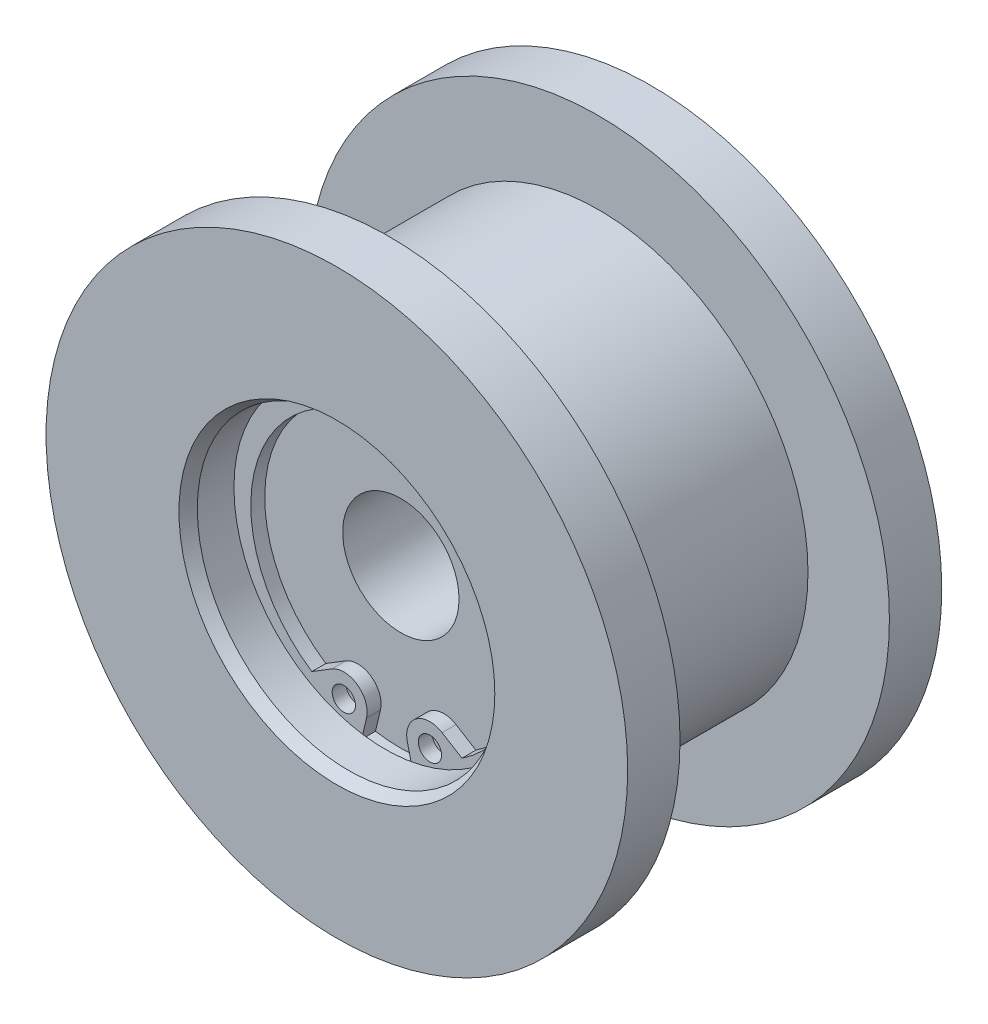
ISO-10303-21;
HEADER;
FILE_DESCRIPTION(('STEP AP214'),'2;1');
FILE_NAME('part.step','',(''),(''),'','','');
FILE_SCHEMA(('AUTOMOTIVE_DESIGN { 1 0 10303 214 1 1 1 1 }'));
ENDSEC;
DATA;
#1=APPLICATION_CONTEXT('core data for automotive mechanical design processes');
#2=APPLICATION_PROTOCOL_DEFINITION('international standard','automotive_design',2000,#1);
#3=PRODUCT_CONTEXT('',#1,'mechanical');
#4=PRODUCT('Part','Part','',(#3));
#5=PRODUCT_RELATED_PRODUCT_CATEGORY('part','',(#4));
#6=PRODUCT_DEFINITION_FORMATION('','',#4);
#7=PRODUCT_DEFINITION_CONTEXT('part definition',#1,'design');
#8=PRODUCT_DEFINITION('design','',#6,#7);
#9=PRODUCT_DEFINITION_SHAPE('','',#8);
#10=(LENGTH_UNIT() NAMED_UNIT(*) SI_UNIT(.MILLI.,.METRE.));
#11=(NAMED_UNIT(*) PLANE_ANGLE_UNIT() SI_UNIT($,.RADIAN.));
#12=(NAMED_UNIT(*) SI_UNIT($,.STERADIAN.) SOLID_ANGLE_UNIT());
#13=UNCERTAINTY_MEASURE_WITH_UNIT(LENGTH_MEASURE(1.E-05),#10,'distance_accuracy_value','');
#14=(GEOMETRIC_REPRESENTATION_CONTEXT(3) GLOBAL_UNCERTAINTY_ASSIGNED_CONTEXT((#13)) GLOBAL_UNIT_ASSIGNED_CONTEXT((#10,
#11,#12)) REPRESENTATION_CONTEXT('',''));
#15=CARTESIAN_POINT('',(0.,0.,0.));
#16=DIRECTION('',(0.,0.,1.));
#17=DIRECTION('',(1.,0.,0.));
#18=AXIS2_PLACEMENT_3D('',#15,#16,#17);
#19=CARTESIAN_POINT('',(0.,-0.75,9.2));
#20=DIRECTION('',(0.,0.,1.));
#21=DIRECTION('',(-1.,0.,0.));
#22=AXIS2_PLACEMENT_3D('',#19,#20,#21);
#23=CYLINDRICAL_SURFACE('',#22,11.7);
#24=CARTESIAN_POINT('',(0.,-0.75,8.));
#25=DIRECTION('',(0.,0.,-1.));
#26=DIRECTION('',(0.,-1.,0.));
#27=AXIS2_PLACEMENT_3D('',#24,#25,#26);
#28=CIRCLE('',#27,11.7);
#29=CARTESIAN_POINT('',(-6.45127454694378,-10.5106893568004,8.));
#30=VERTEX_POINT('',#29);
#31=CARTESIAN_POINT('',(6.45127454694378,-10.5106893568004,8.));
#32=VERTEX_POINT('',#31);
#33=EDGE_CURVE('E105',#30,#32,#28,.T.);
#34=ORIENTED_EDGE('',*,*,#33,.T.);
#35=DIRECTION('',(0.,0.,-1.));
#36=VECTOR('',#35,1.);
#37=CARTESIAN_POINT('',(6.45127454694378,-10.5106893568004,9.2));
#38=LINE('',#37,#36);
#39=CARTESIAN_POINT('',(6.45127454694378,-10.5106893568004,9.2));
#40=VERTEX_POINT('',#39);
#41=EDGE_CURVE('E123',#40,#32,#38,.T.);
#42=ORIENTED_EDGE('',*,*,#41,.F.);
#43=CARTESIAN_POINT('',(0.,-0.75,9.2));
#44=DIRECTION('',(0.,0.,-1.));
#45=DIRECTION('',(0.,-1.,0.));
#46=AXIS2_PLACEMENT_3D('',#43,#44,#45);
#47=CIRCLE('',#46,11.7);
#48=CARTESIAN_POINT('',(-6.45127454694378,-10.5106893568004,9.2));
#49=VERTEX_POINT('',#48);
#50=EDGE_CURVE('E116',#49,#40,#47,.T.);
#51=ORIENTED_EDGE('',*,*,#50,.F.);
#52=DIRECTION('',(0.,0.,-1.));
#53=VECTOR('',#52,1.);
#54=CARTESIAN_POINT('',(-6.45127454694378,-10.5106893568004,9.2));
#55=LINE('',#54,#53);
#56=EDGE_CURVE('E96',#49,#30,#55,.T.);
#57=ORIENTED_EDGE('',*,*,#56,.T.);
#58=EDGE_LOOP('',(#34,#42,#51,#57));
#59=FACE_BOUND('',#58,.T.);
#60=ADVANCED_FACE('F14',(#59),#23,.F.);
#61=CARTESIAN_POINT('',(4.74866968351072,-9.46227797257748,9.2));
#62=DIRECTION('',(-0.524334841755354,-0.851512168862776,0.));
#63=DIRECTION('',(-0.851512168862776,0.524334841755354,0.));
#64=AXIS2_PLACEMENT_3D('',#61,#62,#63);
#65=PLANE('',#64);
#66=DIRECTION('',(-0.851512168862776,0.524334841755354,0.));
#67=VECTOR('',#66,1.);
#68=CARTESIAN_POINT('',(4.74866968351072,-9.46227797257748,8.));
#69=LINE('',#68,#67);
#70=CARTESIAN_POINT('',(4.74866968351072,-9.46227797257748,8.));
#71=VERTEX_POINT('',#70);
#72=EDGE_CURVE('E109',#32,#71,#69,.T.);
#73=ORIENTED_EDGE('',*,*,#72,.T.);
#74=DIRECTION('',(0.,0.,-1.));
#75=VECTOR('',#74,1.);
#76=CARTESIAN_POINT('',(4.74866968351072,-9.46227797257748,9.2));
#77=LINE('',#76,#75);
#78=CARTESIAN_POINT('',(4.74866968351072,-9.46227797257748,9.2));
#79=VERTEX_POINT('',#78);
#80=EDGE_CURVE('E152',#79,#71,#77,.T.);
#81=ORIENTED_EDGE('',*,*,#80,.F.);
#82=DIRECTION('',(-0.851512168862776,0.524334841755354,0.));
#83=VECTOR('',#82,1.);
#84=CARTESIAN_POINT('',(4.74866968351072,-9.46227797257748,9.2));
#85=LINE('',#84,#83);
#86=EDGE_CURVE('E127',#40,#79,#85,.T.);
#87=ORIENTED_EDGE('',*,*,#86,.F.);
#88=ORIENTED_EDGE('',*,*,#41,.T.);
#89=EDGE_LOOP('',(#73,#81,#87,#88));
#90=FACE_BOUND('',#89,.T.);
#91=ADVANCED_FACE('F264',(#90),#65,.F.);
#92=CARTESIAN_POINT('',(3.7,-11.165302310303,9.2));
#93=DIRECTION('',(0.,0.,1.));
#94=DIRECTION('',(-1.,0.,0.));
#95=AXIS2_PLACEMENT_3D('',#92,#93,#94);
#96=CYLINDRICAL_SURFACE('',#95,2.);
#97=CARTESIAN_POINT('',(3.7,-11.165302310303,8.));
#98=DIRECTION('',(0.,0.,1.));
#99=DIRECTION('',(1.,0.,0.));
#100=AXIS2_PLACEMENT_3D('',#97,#98,#99);
#101=CIRCLE('',#100,2.);
#102=CARTESIAN_POINT('',(1.75425849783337,-11.6280009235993,8.));
#103=VERTEX_POINT('',#102);
#104=EDGE_CURVE('E133',#71,#103,#101,.T.);
#105=ORIENTED_EDGE('',*,*,#104,.T.);
#106=DIRECTION('',(0.,0.,-1.));
#107=VECTOR('',#106,1.);
#108=CARTESIAN_POINT('',(1.75425849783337,-11.6280009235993,9.2));
#109=LINE('',#108,#107);
#110=CARTESIAN_POINT('',(1.75425849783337,-11.6280009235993,9.2));
#111=VERTEX_POINT('',#110);
#112=EDGE_CURVE('E144',#111,#103,#109,.T.);
#113=ORIENTED_EDGE('',*,*,#112,.F.);
#114=CARTESIAN_POINT('',(3.7,-11.165302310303,9.2));
#115=DIRECTION('',(0.,0.,1.));
#116=DIRECTION('',(1.,0.,0.));
#117=AXIS2_PLACEMENT_3D('',#114,#115,#116);
#118=CIRCLE('',#117,2.);
#119=EDGE_CURVE('E162',#79,#111,#118,.T.);
#120=ORIENTED_EDGE('',*,*,#119,.F.);
#121=ORIENTED_EDGE('',*,*,#80,.T.);
#122=EDGE_LOOP('',(#105,#113,#120,#121));
#123=FACE_BOUND('',#122,.T.);
#124=ADVANCED_FACE('F269',(#123),#96,.T.);
#125=CARTESIAN_POINT('',(-1.75425849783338,-11.6280009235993,9.2));
#126=DIRECTION('',(-0.97287075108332,0.231349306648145,0.));
#127=DIRECTION('',(0.,0.,1.));
#128=AXIS2_PLACEMENT_3D('',#125,#126,#127);
#129=PLANE('',#128);
#130=DIRECTION('',(0.,0.,1.));
#131=VECTOR('',#130,1.);
#132=CARTESIAN_POINT('',(-2.18133072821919,-13.4239262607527,18.1183293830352));
#133=LINE('',#132,#131);
#134=CARTESIAN_POINT('',(-2.18133072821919,-13.4239262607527,8.));
#135=VERTEX_POINT('',#134);
#136=CARTESIAN_POINT('',(-2.18133072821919,-13.4239262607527,9.2));
#137=VERTEX_POINT('',#136);
#138=EDGE_CURVE('E102',#135,#137,#133,.T.);
#139=ORIENTED_EDGE('',*,*,#138,.F.);
#140=DIRECTION('',(0.231349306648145,0.97287075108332,0.));
#141=VECTOR('',#140,1.);
#142=CARTESIAN_POINT('',(-1.75425849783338,-11.6280009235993,8.));
#143=LINE('',#142,#141);
#144=CARTESIAN_POINT('',(-1.75425849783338,-11.6280009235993,8.));
#145=VERTEX_POINT('',#144);
#146=EDGE_CURVE('E140',#135,#145,#143,.T.);
#147=ORIENTED_EDGE('',*,*,#146,.T.);
#148=DIRECTION('',(0.,0.,-1.));
#149=VECTOR('',#148,1.);
#150=CARTESIAN_POINT('',(-1.75425849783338,-11.6280009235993,9.2));
#151=LINE('',#150,#149);
#152=CARTESIAN_POINT('',(-1.75425849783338,-11.6280009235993,9.2));
#153=VERTEX_POINT('',#152);
#154=EDGE_CURVE('E155',#153,#145,#151,.T.);
#155=ORIENTED_EDGE('',*,*,#154,.F.);
#156=DIRECTION('',(0.231349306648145,0.97287075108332,0.));
#157=VECTOR('',#156,1.);
#158=CARTESIAN_POINT('',(-1.75425849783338,-11.6280009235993,9.2));
#159=LINE('',#158,#157);
#160=EDGE_CURVE('E146',#137,#153,#159,.T.);
#161=ORIENTED_EDGE('',*,*,#160,.F.);
#162=EDGE_LOOP('',(#139,#147,#155,#161));
#163=FACE_BOUND('',#162,.T.);
#164=ADVANCED_FACE('F322',(#163),#129,.F.);
#165=CARTESIAN_POINT('',(0.,-0.75,9.2));
#166=DIRECTION('',(0.,0.,-1.));
#167=DIRECTION('',(0.,-1.,0.));
#168=AXIS2_PLACEMENT_3D('',#165,#166,#167);
#169=PLANE('',#168);
#170=CARTESIAN_POINT('',(3.7,-11.165302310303,9.2));
#171=DIRECTION('',(0.,0.,1.));
#172=DIRECTION('',(1.,0.,0.));
#173=AXIS2_PLACEMENT_3D('',#170,#171,#172);
#174=CIRCLE('',#173,1.);
#175=CARTESIAN_POINT('',(4.7,-11.165302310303,9.2));
#176=VERTEX_POINT('',#175);
#177=EDGE_CURVE('E134',#176,#176,#174,.T.);
#178=ORIENTED_EDGE('',*,*,#177,.F.);
#179=EDGE_LOOP('',(#178));
#180=FACE_BOUND('',#179,.T.);
#181=CARTESIAN_POINT('',(-3.7,-11.165302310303,9.2));
#182=DIRECTION('',(0.,0.,-1.));
#183=DIRECTION('',(1.,0.,0.));
#184=AXIS2_PLACEMENT_3D('',#181,#182,#183);
#185=CIRCLE('',#184,1.);
#186=CARTESIAN_POINT('',(-2.7,-11.165302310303,9.2));
#187=VERTEX_POINT('',#186);
#188=EDGE_CURVE('E129',#187,#187,#185,.T.);
#189=ORIENTED_EDGE('',*,*,#188,.T.);
#190=EDGE_LOOP('',(#189));
#191=FACE_BOUND('',#190,.T.);
#192=CARTESIAN_POINT('',(0.,0.,9.2));
#193=DIRECTION('',(0.,0.,-1.));
#194=DIRECTION('',(-1.,0.,0.));
#195=AXIS2_PLACEMENT_3D('',#192,#193,#194);
#196=CIRCLE('',#195,13.6);
#197=CARTESIAN_POINT('',(2.18133072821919,-13.4239262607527,9.2));
#198=VERTEX_POINT('',#197);
#199=EDGE_CURVE('E9',#137,#198,#196,.T.);
#200=ORIENTED_EDGE('',*,*,#199,.F.);
#201=ORIENTED_EDGE('',*,*,#160,.T.);
#202=CARTESIAN_POINT('',(-3.7,-11.165302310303,9.2));
#203=DIRECTION('',(0.,0.,1.));
#204=DIRECTION('',(-1.,0.,0.));
#205=AXIS2_PLACEMENT_3D('',#202,#203,#204);
#206=CIRCLE('',#205,2.);
#207=CARTESIAN_POINT('',(-4.74866968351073,-9.46227797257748,9.2));
#208=VERTEX_POINT('',#207);
#209=EDGE_CURVE('E132',#153,#208,#206,.T.);
#210=ORIENTED_EDGE('',*,*,#209,.T.);
#211=DIRECTION('',(-0.851512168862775,-0.524334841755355,0.));
#212=VECTOR('',#211,1.);
#213=CARTESIAN_POINT('',(-4.74866968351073,-9.46227797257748,9.2));
#214=LINE('',#213,#212);
#215=EDGE_CURVE('E334',#208,#49,#214,.T.);
#216=ORIENTED_EDGE('',*,*,#215,.T.);
#217=ORIENTED_EDGE('',*,*,#50,.T.);
#218=ORIENTED_EDGE('',*,*,#86,.T.);
#219=ORIENTED_EDGE('',*,*,#119,.T.);
#220=DIRECTION('',(0.231349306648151,-0.972870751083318,0.));
#221=VECTOR('',#220,1.);
#222=CARTESIAN_POINT('',(1.75425849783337,-11.6280009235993,9.2));
#223=LINE('',#222,#221);
#224=EDGE_CURVE('E149',#111,#198,#223,.T.);
#225=ORIENTED_EDGE('',*,*,#224,.T.);
#226=EDGE_LOOP('',(#200,#201,#210,#216,#217,#218,#219,#225));
#227=FACE_BOUND('',#226,.T.);
#228=ADVANCED_FACE('F274',(#180,#191,#227),#169,.F.);
#229=CARTESIAN_POINT('',(3.7,-11.165302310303,9.2));
#230=DIRECTION('',(0.,0.,1.));
#231=DIRECTION('',(-1.,0.,0.));
#232=AXIS2_PLACEMENT_3D('',#229,#230,#231);
#233=CYLINDRICAL_SURFACE('',#232,1.);
#234=CARTESIAN_POINT('',(3.7,-11.165302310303,8.));
#235=DIRECTION('',(0.,0.,1.));
#236=DIRECTION('',(1.,0.,0.));
#237=AXIS2_PLACEMENT_3D('',#234,#235,#236);
#238=CIRCLE('',#237,1.);
#239=CARTESIAN_POINT('',(4.7,-11.165302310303,8.));
#240=VERTEX_POINT('',#239);
#241=EDGE_CURVE('E114',#240,#240,#238,.T.);
#242=ORIENTED_EDGE('',*,*,#241,.F.);
#243=EDGE_LOOP('',(#242));
#244=FACE_BOUND('',#243,.T.);
#245=ORIENTED_EDGE('',*,*,#177,.T.);
#246=EDGE_LOOP('',(#245));
#247=FACE_BOUND('',#246,.T.);
#248=ADVANCED_FACE('F363',(#244,#247),#233,.F.);
#249=CARTESIAN_POINT('',(-3.7,-11.165302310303,9.2));
#250=DIRECTION('',(0.,0.,1.));
#251=DIRECTION('',(-1.,0.,0.));
#252=AXIS2_PLACEMENT_3D('',#249,#250,#251);
#253=CYLINDRICAL_SURFACE('',#252,1.);
#254=CARTESIAN_POINT('',(-3.7,-11.165302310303,8.));
#255=DIRECTION('',(0.,0.,-1.));
#256=DIRECTION('',(1.,0.,0.));
#257=AXIS2_PLACEMENT_3D('',#254,#255,#256);
#258=CIRCLE('',#257,1.);
#259=CARTESIAN_POINT('',(-2.7,-11.165302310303,8.));
#260=VERTEX_POINT('',#259);
#261=EDGE_CURVE('E138',#260,#260,#258,.T.);
#262=ORIENTED_EDGE('',*,*,#261,.T.);
#263=EDGE_LOOP('',(#262));
#264=FACE_BOUND('',#263,.T.);
#265=ORIENTED_EDGE('',*,*,#188,.F.);
#266=EDGE_LOOP('',(#265));
#267=FACE_BOUND('',#266,.T.);
#268=ADVANCED_FACE('F360',(#264,#267),#253,.F.);
#269=CARTESIAN_POINT('',(-4.74866968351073,-9.46227797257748,9.2));
#270=DIRECTION('',(0.524334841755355,-0.851512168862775,0.));
#271=DIRECTION('',(0.,0.,-1.));
#272=AXIS2_PLACEMENT_3D('',#269,#270,#271);
#273=PLANE('',#272);
#274=DIRECTION('',(-0.851512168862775,-0.524334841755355,0.));
#275=VECTOR('',#274,1.);
#276=CARTESIAN_POINT('',(-4.74866968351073,-9.46227797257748,8.));
#277=LINE('',#276,#275);
#278=CARTESIAN_POINT('',(-4.74866968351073,-9.46227797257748,8.));
#279=VERTEX_POINT('',#278);
#280=EDGE_CURVE('E92',#279,#30,#277,.T.);
#281=ORIENTED_EDGE('',*,*,#280,.T.);
#282=ORIENTED_EDGE('',*,*,#56,.F.);
#283=ORIENTED_EDGE('',*,*,#215,.F.);
#284=DIRECTION('',(0.,0.,-1.));
#285=VECTOR('',#284,1.);
#286=CARTESIAN_POINT('',(-4.74866968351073,-9.46227797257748,9.2));
#287=LINE('',#286,#285);
#288=EDGE_CURVE('E99',#208,#279,#287,.T.);
#289=ORIENTED_EDGE('',*,*,#288,.T.);
#290=EDGE_LOOP('',(#281,#282,#283,#289));
#291=FACE_BOUND('',#290,.T.);
#292=ADVANCED_FACE('F94',(#291),#273,.F.);
#293=CARTESIAN_POINT('',(-3.7,-11.165302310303,9.2));
#294=DIRECTION('',(0.,0.,1.));
#295=DIRECTION('',(-1.,0.,0.));
#296=AXIS2_PLACEMENT_3D('',#293,#294,#295);
#297=CYLINDRICAL_SURFACE('',#296,2.);
#298=CARTESIAN_POINT('',(-3.7,-11.165302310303,8.));
#299=DIRECTION('',(0.,0.,1.));
#300=DIRECTION('',(-1.,0.,0.));
#301=AXIS2_PLACEMENT_3D('',#298,#299,#300);
#302=CIRCLE('',#301,2.);
#303=EDGE_CURVE('E145',#145,#279,#302,.T.);
#304=ORIENTED_EDGE('',*,*,#303,.T.);
#305=ORIENTED_EDGE('',*,*,#288,.F.);
#306=ORIENTED_EDGE('',*,*,#209,.F.);
#307=ORIENTED_EDGE('',*,*,#154,.T.);
#308=EDGE_LOOP('',(#304,#305,#306,#307));
#309=FACE_BOUND('',#308,.T.);
#310=ADVANCED_FACE('F261',(#309),#297,.T.);
#311=CARTESIAN_POINT('',(1.75425849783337,-11.6280009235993,9.2));
#312=DIRECTION('',(0.972870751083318,0.231349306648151,0.));
#313=DIRECTION('',(0.,0.,-1.));
#314=AXIS2_PLACEMENT_3D('',#311,#312,#313);
#315=PLANE('',#314);
#316=DIRECTION('',(0.,0.,1.));
#317=VECTOR('',#316,1.);
#318=CARTESIAN_POINT('',(2.1813307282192,-13.4239262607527,18.1183293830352));
#319=LINE('',#318,#317);
#320=CARTESIAN_POINT('',(2.18133072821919,-13.4239262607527,8.));
#321=VERTEX_POINT('',#320);
#322=EDGE_CURVE('E18',#198,#321,#319,.F.);
#323=ORIENTED_EDGE('',*,*,#322,.F.);
#324=ORIENTED_EDGE('',*,*,#224,.F.);
#325=ORIENTED_EDGE('',*,*,#112,.T.);
#326=DIRECTION('',(0.231349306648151,-0.972870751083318,0.));
#327=VECTOR('',#326,1.);
#328=CARTESIAN_POINT('',(1.75425849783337,-11.6280009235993,8.));
#329=LINE('',#328,#327);
#330=EDGE_CURVE('E32',#103,#321,#329,.T.);
#331=ORIENTED_EDGE('',*,*,#330,.T.);
#332=EDGE_LOOP('',(#323,#324,#325,#331));
#333=FACE_BOUND('',#332,.T.);
#334=ADVANCED_FACE('F255',(#333),#315,.F.);
#335=CARTESIAN_POINT('',(0.,5.,8.));
#336=DIRECTION('',(0.,0.,-1.));
#337=DIRECTION('',(-1.,0.,0.));
#338=AXIS2_PLACEMENT_3D('',#335,#336,#337);
#339=PLANE('',#338);
#340=ORIENTED_EDGE('',*,*,#241,.T.);
#341=EDGE_LOOP('',(#340));
#342=FACE_BOUND('',#341,.T.);
#343=ADVANCED_FACE('F247',(#342),#339,.F.);
#344=ORIENTED_EDGE('',*,*,#261,.F.);
#345=EDGE_LOOP('',(#344));
#346=FACE_BOUND('',#345,.T.);
#347=ADVANCED_FACE('F246',(#346),#339,.F.);
#348=CARTESIAN_POINT('',(0.,0.,18.1183293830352));
#349=DIRECTION('',(0.,0.,1.));
#350=DIRECTION('',(1.,0.,0.));
#351=AXIS2_PLACEMENT_3D('',#348,#349,#350);
#352=CYLINDRICAL_SURFACE('',#351,18.);
#353=CARTESIAN_POINT('',(0.,0.,9.));
#354=DIRECTION('',(0.,0.,1.));
#355=DIRECTION('',(1.,0.,0.));
#356=AXIS2_PLACEMENT_3D('',#353,#354,#355);
#357=CIRCLE('',#356,18.);
#358=CARTESIAN_POINT('',(18.,0.,9.));
#359=VERTEX_POINT('',#358);
#360=EDGE_CURVE('E177',#359,#359,#357,.T.);
#361=ORIENTED_EDGE('',*,*,#360,.F.);
#362=EDGE_LOOP('',(#361));
#363=FACE_BOUND('',#362,.T.);
#364=CARTESIAN_POINT('',(0.,0.,-9.));
#365=DIRECTION('',(0.,0.,1.));
#366=DIRECTION('',(1.,0.,0.));
#367=AXIS2_PLACEMENT_3D('',#364,#365,#366);
#368=CIRCLE('',#367,18.);
#369=CARTESIAN_POINT('',(18.,0.,-9.));
#370=VERTEX_POINT('',#369);
#371=EDGE_CURVE('E174',#370,#370,#368,.T.);
#372=ORIENTED_EDGE('',*,*,#371,.T.);
#373=EDGE_LOOP('',(#372));
#374=FACE_BOUND('',#373,.T.);
#375=ADVANCED_FACE('F253',(#363,#374),#352,.T.);
#376=CARTESIAN_POINT('',(0.,18.,9.));
#377=DIRECTION('',(0.,0.,1.));
#378=DIRECTION('',(1.,0.,0.));
#379=AXIS2_PLACEMENT_3D('',#376,#377,#378);
#380=PLANE('',#379);
#381=CARTESIAN_POINT('',(0.,0.,9.));
#382=DIRECTION('',(0.,0.,1.));
#383=DIRECTION('',(1.,0.,0.));
#384=AXIS2_PLACEMENT_3D('',#381,#382,#383);
#385=CIRCLE('',#384,25.);
#386=CARTESIAN_POINT('',(25.,0.,9.));
#387=VERTEX_POINT('',#386);
#388=EDGE_CURVE('E180',#387,#387,#385,.T.);
#389=ORIENTED_EDGE('',*,*,#388,.F.);
#390=EDGE_LOOP('',(#389));
#391=FACE_BOUND('',#390,.T.);
#392=ORIENTED_EDGE('',*,*,#360,.T.);
#393=EDGE_LOOP('',(#392));
#394=FACE_BOUND('',#393,.T.);
#395=ADVANCED_FACE('F280',(#391,#394),#380,.F.);
#396=CARTESIAN_POINT('',(0.,25.,-9.));
#397=DIRECTION('',(0.,0.,-1.));
#398=DIRECTION('',(-1.,0.,0.));
#399=AXIS2_PLACEMENT_3D('',#396,#397,#398);
#400=PLANE('',#399);
#401=ORIENTED_EDGE('',*,*,#371,.F.);
#402=EDGE_LOOP('',(#401));
#403=FACE_BOUND('',#402,.T.);
#404=CARTESIAN_POINT('',(0.,0.,-9.));
#405=DIRECTION('',(0.,0.,1.));
#406=DIRECTION('',(1.,0.,0.));
#407=AXIS2_PLACEMENT_3D('',#404,#405,#406);
#408=CIRCLE('',#407,25.);
#409=CARTESIAN_POINT('',(25.,0.,-9.));
#410=VERTEX_POINT('',#409);
#411=EDGE_CURVE('E171',#410,#410,#408,.T.);
#412=ORIENTED_EDGE('',*,*,#411,.T.);
#413=EDGE_LOOP('',(#412));
#414=FACE_BOUND('',#413,.T.);
#415=ADVANCED_FACE('F276',(#403,#414),#400,.F.);
#416=CARTESIAN_POINT('',(0.,0.,18.1183293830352));
#417=DIRECTION('',(0.,0.,1.));
#418=DIRECTION('',(1.,0.,0.));
#419=AXIS2_PLACEMENT_3D('',#416,#417,#418);
#420=CYLINDRICAL_SURFACE('',#419,25.);
#421=CARTESIAN_POINT('',(0.,0.,13.5));
#422=DIRECTION('',(0.,0.,1.));
#423=DIRECTION('',(1.,0.,0.));
#424=AXIS2_PLACEMENT_3D('',#421,#422,#423);
#425=CIRCLE('',#424,25.);
#426=CARTESIAN_POINT('',(25.,0.,13.5));
#427=VERTEX_POINT('',#426);
#428=EDGE_CURVE('E183',#427,#427,#425,.T.);
#429=ORIENTED_EDGE('',*,*,#428,.F.);
#430=EDGE_LOOP('',(#429));
#431=FACE_BOUND('',#430,.T.);
#432=ORIENTED_EDGE('',*,*,#388,.T.);
#433=EDGE_LOOP('',(#432));
#434=FACE_BOUND('',#433,.T.);
#435=ADVANCED_FACE('F279',(#431,#434),#420,.T.);
#436=CARTESIAN_POINT('',(0.,0.,18.1183293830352));
#437=DIRECTION('',(0.,0.,1.));
#438=DIRECTION('',(1.,0.,0.));
#439=AXIS2_PLACEMENT_3D('',#436,#437,#438);
#440=CYLINDRICAL_SURFACE('',#439,25.);
#441=ORIENTED_EDGE('',*,*,#411,.F.);
#442=EDGE_LOOP('',(#441));
#443=FACE_BOUND('',#442,.T.);
#444=CARTESIAN_POINT('',(0.,0.,-13.5));
#445=DIRECTION('',(0.,0.,1.));
#446=DIRECTION('',(1.,0.,0.));
#447=AXIS2_PLACEMENT_3D('',#444,#445,#446);
#448=CIRCLE('',#447,25.);
#449=CARTESIAN_POINT('',(25.,0.,-13.5));
#450=VERTEX_POINT('',#449);
#451=EDGE_CURVE('E139',#450,#450,#448,.T.);
#452=ORIENTED_EDGE('',*,*,#451,.T.);
#453=EDGE_LOOP('',(#452));
#454=FACE_BOUND('',#453,.T.);
#455=ADVANCED_FACE('F16',(#443,#454),#440,.T.);
#456=CARTESIAN_POINT('',(0.,25.,13.5));
#457=DIRECTION('',(0.,0.,-1.));
#458=DIRECTION('',(-1.,0.,0.));
#459=AXIS2_PLACEMENT_3D('',#456,#457,#458);
#460=PLANE('',#459);
#461=CARTESIAN_POINT('',(0.,0.,13.5));
#462=DIRECTION('',(0.,0.,1.));
#463=DIRECTION('',(1.,0.,0.));
#464=AXIS2_PLACEMENT_3D('',#461,#462,#463);
#465=CIRCLE('',#464,13.5773502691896);
#466=CARTESIAN_POINT('',(13.5773502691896,0.,13.5));
#467=VERTEX_POINT('',#466);
#468=EDGE_CURVE('E186',#467,#467,#465,.T.);
#469=ORIENTED_EDGE('',*,*,#468,.F.);
#470=EDGE_LOOP('',(#469));
#471=FACE_BOUND('',#470,.T.);
#472=ORIENTED_EDGE('',*,*,#428,.T.);
#473=EDGE_LOOP('',(#472));
#474=FACE_BOUND('',#473,.T.);
#475=ADVANCED_FACE('F220',(#471,#474),#460,.F.);
#476=CARTESIAN_POINT('',(0.,11.,-13.5));
#477=DIRECTION('',(0.,0.,1.));
#478=DIRECTION('',(1.,0.,0.));
#479=AXIS2_PLACEMENT_3D('',#476,#477,#478);
#480=PLANE('',#479);
#481=ORIENTED_EDGE('',*,*,#451,.F.);
#482=EDGE_LOOP('',(#481));
#483=FACE_BOUND('',#482,.T.);
#484=CARTESIAN_POINT('',(0.,0.,-13.5));
#485=DIRECTION('',(0.,0.,1.));
#486=DIRECTION('',(1.,0.,0.));
#487=AXIS2_PLACEMENT_3D('',#484,#485,#486);
#488=CIRCLE('',#487,11.);
#489=CARTESIAN_POINT('',(11.,0.,-13.5));
#490=VERTEX_POINT('',#489);
#491=EDGE_CURVE('E209',#490,#490,#488,.T.);
#492=ORIENTED_EDGE('',*,*,#491,.T.);
#493=EDGE_LOOP('',(#492));
#494=FACE_BOUND('',#493,.T.);
#495=ADVANCED_FACE('F216',(#483,#494),#480,.F.);
#496=CARTESIAN_POINT('',(0.,0.,13.5));
#497=DIRECTION('',(0.,0.,1.));
#498=DIRECTION('',(1.,0.,0.));
#499=AXIS2_PLACEMENT_3D('',#496,#497,#498);
#500=CONICAL_SURFACE('',#499,13.5773502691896,0.523598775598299);
#501=CARTESIAN_POINT('',(0.,0.,12.5));
#502=DIRECTION('',(0.,0.,1.));
#503=DIRECTION('',(1.,0.,0.));
#504=AXIS2_PLACEMENT_3D('',#501,#502,#503);
#505=CIRCLE('',#504,13.);
#506=CARTESIAN_POINT('',(13.,0.,12.5));
#507=VERTEX_POINT('',#506);
#508=EDGE_CURVE('E189',#507,#507,#505,.T.);
#509=ORIENTED_EDGE('',*,*,#508,.F.);
#510=EDGE_LOOP('',(#509));
#511=FACE_BOUND('',#510,.T.);
#512=ORIENTED_EDGE('',*,*,#468,.T.);
#513=EDGE_LOOP('',(#512));
#514=FACE_BOUND('',#513,.T.);
#515=ADVANCED_FACE('F219',(#511,#514),#500,.F.);
#516=CARTESIAN_POINT('',(0.,0.,18.1183293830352));
#517=DIRECTION('',(0.,0.,1.));
#518=DIRECTION('',(1.,0.,0.));
#519=AXIS2_PLACEMENT_3D('',#516,#517,#518);
#520=CYLINDRICAL_SURFACE('',#519,11.);
#521=ORIENTED_EDGE('',*,*,#491,.F.);
#522=EDGE_LOOP('',(#521));
#523=FACE_BOUND('',#522,.T.);
#524=CARTESIAN_POINT('',(0.,0.,-8.));
#525=DIRECTION('',(0.,0.,1.));
#526=DIRECTION('',(1.,0.,0.));
#527=AXIS2_PLACEMENT_3D('',#524,#525,#526);
#528=CIRCLE('',#527,11.);
#529=CARTESIAN_POINT('',(11.,0.,-8.));
#530=VERTEX_POINT('',#529);
#531=EDGE_CURVE('E206',#530,#530,#528,.T.);
#532=ORIENTED_EDGE('',*,*,#531,.T.);
#533=EDGE_LOOP('',(#532));
#534=FACE_BOUND('',#533,.T.);
#535=ADVANCED_FACE('F223',(#523,#534),#520,.F.);
#536=CARTESIAN_POINT('',(0.,0.,18.1183293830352));
#537=DIRECTION('',(0.,0.,1.));
#538=DIRECTION('',(1.,0.,0.));
#539=AXIS2_PLACEMENT_3D('',#536,#537,#538);
#540=CYLINDRICAL_SURFACE('',#539,13.);
#541=CARTESIAN_POINT('',(0.,0.,9.35));
#542=DIRECTION('',(0.,0.,1.));
#543=DIRECTION('',(1.,0.,0.));
#544=AXIS2_PLACEMENT_3D('',#541,#542,#543);
#545=CIRCLE('',#544,13.);
#546=CARTESIAN_POINT('',(13.,0.,9.35));
#547=VERTEX_POINT('',#546);
#548=EDGE_CURVE('E192',#547,#547,#545,.T.);
#549=ORIENTED_EDGE('',*,*,#548,.F.);
#550=EDGE_LOOP('',(#549));
#551=FACE_BOUND('',#550,.T.);
#552=ORIENTED_EDGE('',*,*,#508,.T.);
#553=EDGE_LOOP('',(#552));
#554=FACE_BOUND('',#553,.T.);
#555=ADVANCED_FACE('F226',(#551,#554),#540,.F.);
#556=CARTESIAN_POINT('',(0.,11.,-8.));
#557=DIRECTION('',(0.,0.,1.));
#558=DIRECTION('',(1.,0.,0.));
#559=AXIS2_PLACEMENT_3D('',#556,#557,#558);
#560=PLANE('',#559);
#561=ORIENTED_EDGE('',*,*,#531,.F.);
#562=EDGE_LOOP('',(#561));
#563=FACE_BOUND('',#562,.T.);
#564=CARTESIAN_POINT('',(0.,0.,-8.));
#565=DIRECTION('',(0.,0.,1.));
#566=DIRECTION('',(1.,0.,0.));
#567=AXIS2_PLACEMENT_3D('',#564,#565,#566);
#568=CIRCLE('',#567,5.);
#569=CARTESIAN_POINT('',(5.,0.,-8.));
#570=VERTEX_POINT('',#569);
#571=EDGE_CURVE('E203',#570,#570,#568,.T.);
#572=ORIENTED_EDGE('',*,*,#571,.T.);
#573=EDGE_LOOP('',(#572));
#574=FACE_BOUND('',#573,.T.);
#575=ADVANCED_FACE('F230',(#563,#574),#560,.F.);
#576=CARTESIAN_POINT('',(0.,13.6,9.35));
#577=DIRECTION('',(0.,0.,1.));
#578=DIRECTION('',(1.,0.,0.));
#579=AXIS2_PLACEMENT_3D('',#576,#577,#578);
#580=PLANE('',#579);
#581=CARTESIAN_POINT('',(0.,0.,9.35));
#582=DIRECTION('',(0.,0.,1.));
#583=DIRECTION('',(1.,0.,0.));
#584=AXIS2_PLACEMENT_3D('',#581,#582,#583);
#585=CIRCLE('',#584,13.6);
#586=CARTESIAN_POINT('',(13.6,0.,9.35));
#587=VERTEX_POINT('',#586);
#588=EDGE_CURVE('E195',#587,#587,#585,.T.);
#589=ORIENTED_EDGE('',*,*,#588,.F.);
#590=EDGE_LOOP('',(#589));
#591=FACE_BOUND('',#590,.T.);
#592=ORIENTED_EDGE('',*,*,#548,.T.);
#593=EDGE_LOOP('',(#592));
#594=FACE_BOUND('',#593,.T.);
#595=ADVANCED_FACE('F233',(#591,#594),#580,.F.);
#596=CARTESIAN_POINT('',(0.,0.,18.1183293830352));
#597=DIRECTION('',(0.,0.,1.));
#598=DIRECTION('',(1.,0.,0.));
#599=AXIS2_PLACEMENT_3D('',#596,#597,#598);
#600=CYLINDRICAL_SURFACE('',#599,13.6);
#601=ORIENTED_EDGE('',*,*,#588,.T.);
#602=EDGE_LOOP('',(#601));
#603=FACE_BOUND('',#602,.T.);
#604=ORIENTED_EDGE('',*,*,#199,.T.);
#605=ORIENTED_EDGE('',*,*,#322,.T.);
#606=CARTESIAN_POINT('',(0.,0.,8.));
#607=DIRECTION('',(0.,0.,1.));
#608=DIRECTION('',(1.,0.,0.));
#609=AXIS2_PLACEMENT_3D('',#606,#607,#608);
#610=CIRCLE('',#609,13.6);
#611=EDGE_CURVE('E198',#135,#321,#610,.T.);
#612=ORIENTED_EDGE('',*,*,#611,.F.);
#613=ORIENTED_EDGE('',*,*,#138,.T.);
#614=EDGE_LOOP('',(#604,#605,#612,#613));
#615=FACE_BOUND('',#614,.T.);
#616=ADVANCED_FACE('F240',(#603,#615),#600,.F.);
#617=CARTESIAN_POINT('',(0.,0.,18.1183293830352));
#618=DIRECTION('',(0.,0.,1.));
#619=DIRECTION('',(1.,0.,0.));
#620=AXIS2_PLACEMENT_3D('',#617,#618,#619);
#621=CYLINDRICAL_SURFACE('',#620,5.);
#622=ORIENTED_EDGE('',*,*,#571,.F.);
#623=EDGE_LOOP('',(#622));
#624=FACE_BOUND('',#623,.T.);
#625=CARTESIAN_POINT('',(0.,0.,8.));
#626=DIRECTION('',(0.,0.,1.));
#627=DIRECTION('',(1.,0.,0.));
#628=AXIS2_PLACEMENT_3D('',#625,#626,#627);
#629=CIRCLE('',#628,5.);
#630=CARTESIAN_POINT('',(5.,0.,8.));
#631=VERTEX_POINT('',#630);
#632=EDGE_CURVE('E200',#631,#631,#629,.T.);
#633=ORIENTED_EDGE('',*,*,#632,.T.);
#634=EDGE_LOOP('',(#633));
#635=FACE_BOUND('',#634,.T.);
#636=ADVANCED_FACE('F237',(#624,#635),#621,.F.);
#637=ORIENTED_EDGE('',*,*,#632,.F.);
#638=EDGE_LOOP('',(#637));
#639=FACE_BOUND('',#638,.T.);
#640=ORIENTED_EDGE('',*,*,#611,.T.);
#641=ORIENTED_EDGE('',*,*,#330,.F.);
#642=ORIENTED_EDGE('',*,*,#104,.F.);
#643=ORIENTED_EDGE('',*,*,#72,.F.);
#644=ORIENTED_EDGE('',*,*,#33,.F.);
#645=ORIENTED_EDGE('',*,*,#280,.F.);
#646=ORIENTED_EDGE('',*,*,#303,.F.);
#647=ORIENTED_EDGE('',*,*,#146,.F.);
#648=EDGE_LOOP('',(#640,#641,#642,#643,#644,#645,#646,#647));
#649=FACE_BOUND('',#648,.T.);
#650=ADVANCED_FACE('F107',(#639,#649),#339,.F.);
#651=CLOSED_SHELL('',(#60,#91,#124,#164,#228,#248,#268,#292,#310,#334,#343,#347,#375,#395,#415,
#435,#455,#475,#495,#515,#535,#555,#575,#595,#616,#636,#650));
#652=MANIFOLD_SOLID_BREP('B1',#651);
#653=ADVANCED_BREP_SHAPE_REPRESENTATION('',(#18,#652),#14);
#654=SHAPE_DEFINITION_REPRESENTATION(#9,#653);
ENDSEC;
END-ISO-10303-21;
